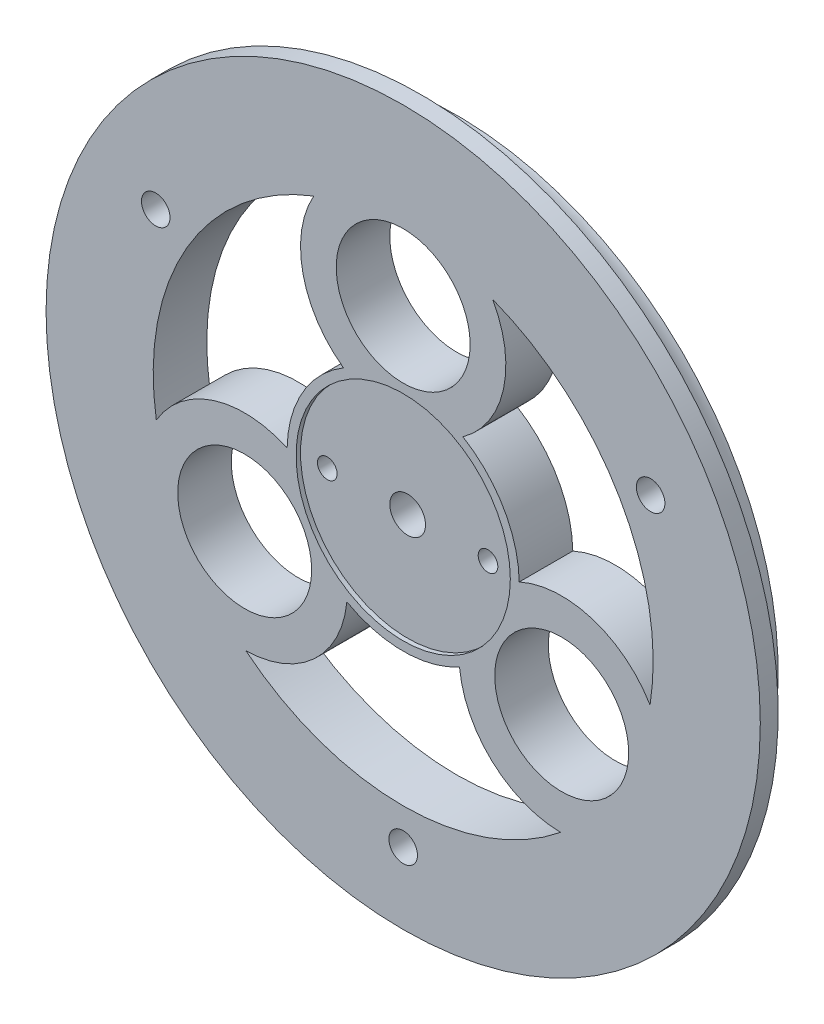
ISO-10303-21;
HEADER;
FILE_DESCRIPTION(('STEP AP214'),'2;1');
FILE_NAME('part.step','',(''),(''),'','','');
FILE_SCHEMA(('AUTOMOTIVE_DESIGN { 1 0 10303 214 1 1 1 1 }'));
ENDSEC;
DATA;
#1=APPLICATION_CONTEXT('core data for automotive mechanical design processes');
#2=APPLICATION_PROTOCOL_DEFINITION('international standard','automotive_design',2000,#1);
#3=PRODUCT_CONTEXT('',#1,'mechanical');
#4=PRODUCT('Part','Part','',(#3));
#5=PRODUCT_RELATED_PRODUCT_CATEGORY('part','',(#4));
#6=PRODUCT_DEFINITION_FORMATION('','',#4);
#7=PRODUCT_DEFINITION_CONTEXT('part definition',#1,'design');
#8=PRODUCT_DEFINITION('design','',#6,#7);
#9=PRODUCT_DEFINITION_SHAPE('','',#8);
#10=(LENGTH_UNIT() NAMED_UNIT(*) SI_UNIT(.MILLI.,.METRE.));
#11=(NAMED_UNIT(*) PLANE_ANGLE_UNIT() SI_UNIT($,.RADIAN.));
#12=(NAMED_UNIT(*) SI_UNIT($,.STERADIAN.) SOLID_ANGLE_UNIT());
#13=UNCERTAINTY_MEASURE_WITH_UNIT(LENGTH_MEASURE(1.E-05),#10,'distance_accuracy_value','');
#14=(GEOMETRIC_REPRESENTATION_CONTEXT(3) GLOBAL_UNCERTAINTY_ASSIGNED_CONTEXT((#13)) GLOBAL_UNIT_ASSIGNED_CONTEXT((#10,
#11,#12)) REPRESENTATION_CONTEXT('',''));
#15=CARTESIAN_POINT('',(0.,0.,0.));
#16=DIRECTION('',(0.,0.,1.));
#17=DIRECTION('',(1.,0.,0.));
#18=AXIS2_PLACEMENT_3D('',#15,#16,#17);
#19=CARTESIAN_POINT('',(0.,0.,6.));
#20=DIRECTION('',(0.,0.,-1.));
#21=DIRECTION('',(-1.,0.,0.));
#22=AXIS2_PLACEMENT_3D('',#19,#20,#21);
#23=CYLINDRICAL_SURFACE('',#22,2.);
#24=CARTESIAN_POINT('',(0.,0.,0.));
#25=DIRECTION('',(0.,0.,1.));
#26=DIRECTION('',(1.,0.,0.));
#27=AXIS2_PLACEMENT_3D('',#24,#25,#26);
#28=CIRCLE('',#27,2.);
#29=CARTESIAN_POINT('',(2.,0.,0.));
#30=VERTEX_POINT('',#29);
#31=EDGE_CURVE('E39',#30,#30,#28,.T.);
#32=ORIENTED_EDGE('',*,*,#31,.F.);
#33=EDGE_LOOP('',(#32));
#34=FACE_BOUND('',#33,.T.);
#35=CARTESIAN_POINT('',(0.,0.,5.5));
#36=DIRECTION('',(0.,0.,1.));
#37=DIRECTION('',(1.,0.,0.));
#38=AXIS2_PLACEMENT_3D('',#35,#36,#37);
#39=CIRCLE('',#38,2.);
#40=CARTESIAN_POINT('',(2.,0.,5.5));
#41=VERTEX_POINT('',#40);
#42=EDGE_CURVE('E268',#41,#41,#39,.T.);
#43=ORIENTED_EDGE('',*,*,#42,.T.);
#44=EDGE_LOOP('',(#43));
#45=FACE_BOUND('',#44,.T.);
#46=ADVANCED_FACE('F30',(#34,#45),#23,.F.);
#47=CARTESIAN_POINT('',(8.99999999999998,0.,6.));
#48=DIRECTION('',(0.,0.,-1.));
#49=DIRECTION('',(-1.,0.,0.));
#50=AXIS2_PLACEMENT_3D('',#47,#48,#49);
#51=CYLINDRICAL_SURFACE('',#50,1.1);
#52=CARTESIAN_POINT('',(8.99999999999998,0.,0.));
#53=DIRECTION('',(0.,0.,1.));
#54=DIRECTION('',(1.,0.,0.));
#55=AXIS2_PLACEMENT_3D('',#52,#53,#54);
#56=CIRCLE('',#55,1.1);
#57=CARTESIAN_POINT('',(10.1,0.,0.));
#58=VERTEX_POINT('',#57);
#59=EDGE_CURVE('E143',#58,#58,#56,.T.);
#60=ORIENTED_EDGE('',*,*,#59,.F.);
#61=EDGE_LOOP('',(#60));
#62=FACE_BOUND('',#61,.T.);
#63=CARTESIAN_POINT('',(8.99999999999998,0.,5.5));
#64=DIRECTION('',(0.,0.,1.));
#65=DIRECTION('',(1.,0.,0.));
#66=AXIS2_PLACEMENT_3D('',#63,#64,#65);
#67=CIRCLE('',#66,1.1);
#68=CARTESIAN_POINT('',(10.1,0.,5.5));
#69=VERTEX_POINT('',#68);
#70=EDGE_CURVE('E273',#69,#69,#67,.T.);
#71=ORIENTED_EDGE('',*,*,#70,.T.);
#72=EDGE_LOOP('',(#71));
#73=FACE_BOUND('',#72,.T.);
#74=ADVANCED_FACE('F329',(#62,#73),#51,.F.);
#75=CARTESIAN_POINT('',(-8.99999999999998,0.,6.));
#76=DIRECTION('',(0.,0.,-1.));
#77=DIRECTION('',(-1.,0.,0.));
#78=AXIS2_PLACEMENT_3D('',#75,#76,#77);
#79=CYLINDRICAL_SURFACE('',#78,1.1);
#80=CARTESIAN_POINT('',(-8.99999999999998,0.,0.));
#81=DIRECTION('',(0.,0.,1.));
#82=DIRECTION('',(-1.,0.,0.));
#83=AXIS2_PLACEMENT_3D('',#80,#81,#82);
#84=CIRCLE('',#83,1.1);
#85=CARTESIAN_POINT('',(-10.1,0.,0.));
#86=VERTEX_POINT('',#85);
#87=EDGE_CURVE('E146',#86,#86,#84,.T.);
#88=ORIENTED_EDGE('',*,*,#87,.F.);
#89=EDGE_LOOP('',(#88));
#90=FACE_BOUND('',#89,.T.);
#91=CARTESIAN_POINT('',(-8.99999999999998,0.,5.5));
#92=DIRECTION('',(0.,0.,1.));
#93=DIRECTION('',(1.,0.,0.));
#94=AXIS2_PLACEMENT_3D('',#91,#92,#93);
#95=CIRCLE('',#94,1.1);
#96=CARTESIAN_POINT('',(-7.89999999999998,0.,5.5));
#97=VERTEX_POINT('',#96);
#98=EDGE_CURVE('E34',#97,#97,#95,.T.);
#99=ORIENTED_EDGE('',*,*,#98,.T.);
#100=EDGE_LOOP('',(#99));
#101=FACE_BOUND('',#100,.T.);
#102=ADVANCED_FACE('F335',(#90,#101),#79,.F.);
#103=CARTESIAN_POINT('',(0.,0.,0.));
#104=DIRECTION('',(0.,0.,1.));
#105=DIRECTION('',(1.,0.,0.));
#106=AXIS2_PLACEMENT_3D('',#103,#104,#105);
#107=PLANE('',#106);
#108=ORIENTED_EDGE('',*,*,#87,.T.);
#109=EDGE_LOOP('',(#108));
#110=FACE_BOUND('',#109,.T.);
#111=CARTESIAN_POINT('',(0.,0.,0.));
#112=DIRECTION('',(0.,0.,1.));
#113=DIRECTION('',(1.,0.,0.));
#114=AXIS2_PLACEMENT_3D('',#111,#112,#113);
#115=CIRCLE('',#114,28.0000000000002);
#116=CARTESIAN_POINT('',(-10.0184244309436,26.1463414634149,0.));
#117=VERTEX_POINT('',#116);
#118=CARTESIAN_POINT('',(-27.6526081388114,-4.39696066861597,0.));
#119=VERTEX_POINT('',#118);
#120=EDGE_CURVE('E55',#117,#119,#115,.T.);
#121=ORIENTED_EDGE('',*,*,#120,.T.);
#122=CARTESIAN_POINT('',(-17.7535207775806,-10.2500000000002,0.));
#123=DIRECTION('',(0.,0.,-1.));
#124=DIRECTION('',(1.,0.,0.));
#125=AXIS2_PLACEMENT_3D('',#122,#123,#124);
#126=CIRCLE('',#125,11.5000000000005);
#127=CARTESIAN_POINT('',(-12.998125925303,0.220731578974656,0.));
#128=VERTEX_POINT('',#127);
#129=EDGE_CURVE('E123',#119,#128,#126,.T.);
#130=ORIENTED_EDGE('',*,*,#129,.T.);
#131=CARTESIAN_POINT('',(0.,0.,0.));
#132=DIRECTION('',(0.,0.,-1.));
#133=DIRECTION('',(1.,0.,0.));
#134=AXIS2_PLACEMENT_3D('',#131,#132,#133);
#135=CIRCLE('',#134,12.9999999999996);
#136=CARTESIAN_POINT('',(-6.69022211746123,11.146341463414,0.));
#137=VERTEX_POINT('',#136);
#138=EDGE_CURVE('E132',#128,#137,#135,.T.);
#139=ORIENTED_EDGE('',*,*,#138,.T.);
#140=CARTESIAN_POINT('',(0.,20.5,0.));
#141=DIRECTION('',(0.,0.,-1.));
#142=DIRECTION('',(1.,0.,0.));
#143=AXIS2_PLACEMENT_3D('',#140,#141,#142);
#144=CIRCLE('',#143,11.5000000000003);
#145=EDGE_CURVE('E142',#137,#117,#144,.T.);
#146=ORIENTED_EDGE('',*,*,#145,.T.);
#147=EDGE_LOOP('',(#121,#130,#139,#146));
#148=FACE_BOUND('',#147,.T.);
#149=CARTESIAN_POINT('',(1.77712048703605E-13,-32.0000000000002,0.));
#150=DIRECTION('',(0.,0.,1.));
#151=DIRECTION('',(1.,0.,0.));
#152=AXIS2_PLACEMENT_3D('',#149,#150,#151);
#153=CIRCLE('',#152,1.6);
#154=CARTESIAN_POINT('',(1.60000000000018,-32.0000000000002,0.));
#155=VERTEX_POINT('',#154);
#156=EDGE_CURVE('E168',#155,#155,#153,.T.);
#157=ORIENTED_EDGE('',*,*,#156,.T.);
#158=EDGE_LOOP('',(#157));
#159=FACE_BOUND('',#158,.T.);
#160=CARTESIAN_POINT('',(27.7128129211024,16.0000000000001,0.));
#161=DIRECTION('',(0.,0.,1.));
#162=DIRECTION('',(1.,0.,0.));
#163=AXIS2_PLACEMENT_3D('',#160,#161,#162);
#164=CIRCLE('',#163,1.6);
#165=CARTESIAN_POINT('',(29.3128129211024,16.0000000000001,0.));
#166=VERTEX_POINT('',#165);
#167=EDGE_CURVE('E180',#166,#166,#164,.T.);
#168=ORIENTED_EDGE('',*,*,#167,.T.);
#169=EDGE_LOOP('',(#168));
#170=FACE_BOUND('',#169,.T.);
#171=CARTESIAN_POINT('',(0.,20.5,0.));
#172=DIRECTION('',(0.,0.,-1.));
#173=DIRECTION('',(1.,0.,0.));
#174=AXIS2_PLACEMENT_3D('',#171,#172,#173);
#175=CIRCLE('',#174,11.5000000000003);
#176=CARTESIAN_POINT('',(10.0184244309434,26.1463414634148,0.));
#177=VERTEX_POINT('',#176);
#178=CARTESIAN_POINT('',(6.69022211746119,11.1463414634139,0.));
#179=VERTEX_POINT('',#178);
#180=EDGE_CURVE('E217',#177,#179,#175,.T.);
#181=ORIENTED_EDGE('',*,*,#180,.T.);
#182=CARTESIAN_POINT('',(0.,0.,0.));
#183=DIRECTION('',(0.,0.,-1.));
#184=DIRECTION('',(1.,0.,0.));
#185=AXIS2_PLACEMENT_3D('',#182,#183,#184);
#186=CIRCLE('',#185,12.9999999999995);
#187=CARTESIAN_POINT('',(12.9981259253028,0.220731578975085,0.));
#188=VERTEX_POINT('',#187);
#189=EDGE_CURVE('E220',#179,#188,#186,.T.);
#190=ORIENTED_EDGE('',*,*,#189,.T.);
#191=CARTESIAN_POINT('',(17.7535207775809,-10.2500000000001,0.));
#192=DIRECTION('',(0.,0.,-1.));
#193=DIRECTION('',(1.,0.,0.));
#194=AXIS2_PLACEMENT_3D('',#191,#192,#193);
#195=CIRCLE('',#194,11.5000000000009);
#196=CARTESIAN_POINT('',(27.6526081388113,-4.39696066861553,0.));
#197=VERTEX_POINT('',#196);
#198=EDGE_CURVE('E223',#188,#197,#195,.T.);
#199=ORIENTED_EDGE('',*,*,#198,.T.);
#200=CARTESIAN_POINT('',(0.,0.,0.));
#201=DIRECTION('',(0.,0.,1.));
#202=DIRECTION('',(1.,0.,0.));
#203=AXIS2_PLACEMENT_3D('',#200,#201,#202);
#204=CIRCLE('',#203,28.0000000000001);
#205=EDGE_CURVE('E226',#197,#177,#204,.T.);
#206=ORIENTED_EDGE('',*,*,#205,.T.);
#207=EDGE_LOOP('',(#181,#190,#199,#206));
#208=FACE_BOUND('',#207,.T.);
#209=CARTESIAN_POINT('',(0.,20.5,0.));
#210=DIRECTION('',(0.,0.,1.));
#211=DIRECTION('',(1.,0.,0.));
#212=AXIS2_PLACEMENT_3D('',#209,#210,#211);
#213=CIRCLE('',#212,7.5);
#214=CARTESIAN_POINT('',(7.5,20.5,0.));
#215=VERTEX_POINT('',#214);
#216=EDGE_CURVE('E254',#215,#215,#213,.T.);
#217=ORIENTED_EDGE('',*,*,#216,.T.);
#218=EDGE_LOOP('',(#217));
#219=FACE_BOUND('',#218,.T.);
#220=ORIENTED_EDGE('',*,*,#31,.T.);
#221=EDGE_LOOP('',(#220));
#222=FACE_BOUND('',#221,.T.);
#223=CARTESIAN_POINT('',(-27.712812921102,16.0000000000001,0.));
#224=DIRECTION('',(0.,0.,1.));
#225=DIRECTION('',(1.,0.,0.));
#226=AXIS2_PLACEMENT_3D('',#223,#224,#225);
#227=CIRCLE('',#226,1.6);
#228=CARTESIAN_POINT('',(-26.112812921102,16.0000000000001,0.));
#229=VERTEX_POINT('',#228);
#230=EDGE_CURVE('E248',#229,#229,#227,.T.);
#231=ORIENTED_EDGE('',*,*,#230,.T.);
#232=EDGE_LOOP('',(#231));
#233=FACE_BOUND('',#232,.T.);
#234=CARTESIAN_POINT('',(0.,0.,0.));
#235=DIRECTION('',(0.,0.,1.));
#236=DIRECTION('',(1.,0.,0.));
#237=AXIS2_PLACEMENT_3D('',#234,#235,#236);
#238=CIRCLE('',#237,28.);
#239=CARTESIAN_POINT('',(-17.6341837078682,-21.7493807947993,0.));
#240=VERTEX_POINT('',#239);
#241=CARTESIAN_POINT('',(17.6341837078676,-21.7493807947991,0.));
#242=VERTEX_POINT('',#241);
#243=EDGE_CURVE('E186',#240,#242,#238,.T.);
#244=ORIENTED_EDGE('',*,*,#243,.T.);
#245=CARTESIAN_POINT('',(17.7535207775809,-10.2500000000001,0.));
#246=DIRECTION('',(0.,0.,-1.));
#247=DIRECTION('',(1.,0.,0.));
#248=AXIS2_PLACEMENT_3D('',#245,#246,#247);
#249=CIRCLE('',#248,11.5);
#250=CARTESIAN_POINT('',(6.30790380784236,-11.367073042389,0.));
#251=VERTEX_POINT('',#250);
#252=EDGE_CURVE('E189',#242,#251,#249,.T.);
#253=ORIENTED_EDGE('',*,*,#252,.T.);
#254=CARTESIAN_POINT('',(0.,0.,0.));
#255=DIRECTION('',(0.,0.,-1.));
#256=DIRECTION('',(1.,0.,0.));
#257=AXIS2_PLACEMENT_3D('',#254,#255,#256);
#258=CIRCLE('',#257,13.);
#259=CARTESIAN_POINT('',(-6.30790380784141,-11.3670730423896,0.));
#260=VERTEX_POINT('',#259);
#261=EDGE_CURVE('E192',#251,#260,#258,.T.);
#262=ORIENTED_EDGE('',*,*,#261,.T.);
#263=CARTESIAN_POINT('',(-17.7535207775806,-10.2500000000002,0.));
#264=DIRECTION('',(0.,0.,-1.));
#265=DIRECTION('',(1.,0.,0.));
#266=AXIS2_PLACEMENT_3D('',#263,#264,#265);
#267=CIRCLE('',#266,11.5);
#268=EDGE_CURVE('E195',#260,#240,#267,.T.);
#269=ORIENTED_EDGE('',*,*,#268,.T.);
#270=EDGE_LOOP('',(#244,#253,#262,#269));
#271=FACE_BOUND('',#270,.T.);
#272=CARTESIAN_POINT('',(17.7535207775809,-10.2500000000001,0.));
#273=DIRECTION('',(0.,0.,1.));
#274=DIRECTION('',(1.,0.,0.));
#275=AXIS2_PLACEMENT_3D('',#272,#273,#274);
#276=CIRCLE('',#275,7.5);
#277=CARTESIAN_POINT('',(25.253520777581,-10.2500000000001,0.));
#278=VERTEX_POINT('',#277);
#279=EDGE_CURVE('E174',#278,#278,#276,.T.);
#280=ORIENTED_EDGE('',*,*,#279,.T.);
#281=EDGE_LOOP('',(#280));
#282=FACE_BOUND('',#281,.T.);
#283=CARTESIAN_POINT('',(-17.7535207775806,-10.2500000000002,0.));
#284=DIRECTION('',(0.,0.,1.));
#285=DIRECTION('',(1.,0.,0.));
#286=AXIS2_PLACEMENT_3D('',#283,#284,#285);
#287=CIRCLE('',#286,7.50000000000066);
#288=CARTESIAN_POINT('',(-10.2535207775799,-10.2500000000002,0.));
#289=VERTEX_POINT('',#288);
#290=EDGE_CURVE('E137',#289,#289,#287,.T.);
#291=ORIENTED_EDGE('',*,*,#290,.T.);
#292=EDGE_LOOP('',(#291));
#293=FACE_BOUND('',#292,.T.);
#294=ORIENTED_EDGE('',*,*,#59,.T.);
#295=EDGE_LOOP('',(#294));
#296=FACE_BOUND('',#295,.T.);
#297=CARTESIAN_POINT('',(0.,0.,0.));
#298=DIRECTION('',(0.,0.,-1.));
#299=DIRECTION('',(-1.,0.,0.));
#300=AXIS2_PLACEMENT_3D('',#297,#298,#299);
#301=CIRCLE('',#300,36.);
#302=CARTESIAN_POINT('',(-36.,0.,0.));
#303=VERTEX_POINT('',#302);
#304=EDGE_CURVE('E263',#303,#303,#301,.T.);
#305=ORIENTED_EDGE('',*,*,#304,.T.);
#306=EDGE_LOOP('',(#305));
#307=FACE_BOUND('',#306,.T.);
#308=ADVANCED_FACE('F140',(#110,#148,#159,#170,#208,#219,#222,#233,#271,#282,#293,#296,#307),
#107,.F.);
#309=CARTESIAN_POINT('',(0.,0.,6.));
#310=DIRECTION('',(0.,0.,-1.));
#311=DIRECTION('',(-1.,0.,0.));
#312=AXIS2_PLACEMENT_3D('',#309,#310,#311);
#313=CYLINDRICAL_SURFACE('',#312,40.);
#314=CARTESIAN_POINT('',(0.,0.,6.));
#315=DIRECTION('',(0.,0.,1.));
#316=DIRECTION('',(1.,0.,0.));
#317=AXIS2_PLACEMENT_3D('',#314,#315,#316);
#318=CIRCLE('',#317,40.);
#319=CARTESIAN_POINT('',(40.,0.,6.));
#320=VERTEX_POINT('',#319);
#321=EDGE_CURVE('E11',#320,#320,#318,.T.);
#322=ORIENTED_EDGE('',*,*,#321,.F.);
#323=EDGE_LOOP('',(#322));
#324=FACE_BOUND('',#323,.T.);
#325=CARTESIAN_POINT('',(0.,0.,4.));
#326=DIRECTION('',(0.,0.,-1.));
#327=DIRECTION('',(-1.,0.,0.));
#328=AXIS2_PLACEMENT_3D('',#325,#326,#327);
#329=CIRCLE('',#328,40.);
#330=CARTESIAN_POINT('',(-40.,0.,4.));
#331=VERTEX_POINT('',#330);
#332=EDGE_CURVE('E261',#331,#331,#329,.T.);
#333=ORIENTED_EDGE('',*,*,#332,.F.);
#334=EDGE_LOOP('',(#333));
#335=FACE_BOUND('',#334,.T.);
#336=ADVANCED_FACE('F32',(#324,#335),#313,.T.);
#337=CARTESIAN_POINT('',(0.,0.,6.));
#338=DIRECTION('',(0.,0.,1.));
#339=DIRECTION('',(1.,0.,0.));
#340=AXIS2_PLACEMENT_3D('',#337,#338,#339);
#341=PLANE('',#340);
#342=CARTESIAN_POINT('',(0.,0.,6.));
#343=DIRECTION('',(0.,0.,1.));
#344=DIRECTION('',(1.,0.,0.));
#345=AXIS2_PLACEMENT_3D('',#342,#343,#344);
#346=CIRCLE('',#345,12.);
#347=CARTESIAN_POINT('',(12.,0.,6.));
#348=VERTEX_POINT('',#347);
#349=EDGE_CURVE('E281',#348,#348,#346,.T.);
#350=ORIENTED_EDGE('',*,*,#349,.F.);
#351=EDGE_LOOP('',(#350));
#352=FACE_BOUND('',#351,.T.);
#353=CARTESIAN_POINT('',(-17.7535207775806,-10.2500000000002,6.));
#354=DIRECTION('',(0.,0.,1.));
#355=DIRECTION('',(1.,0.,0.));
#356=AXIS2_PLACEMENT_3D('',#353,#354,#355);
#357=CIRCLE('',#356,7.50000000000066);
#358=CARTESIAN_POINT('',(-10.2535207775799,-10.2500000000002,6.));
#359=VERTEX_POINT('',#358);
#360=EDGE_CURVE('E165',#359,#359,#357,.T.);
#361=ORIENTED_EDGE('',*,*,#360,.F.);
#362=EDGE_LOOP('',(#361));
#363=FACE_BOUND('',#362,.T.);
#364=CARTESIAN_POINT('',(17.7535207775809,-10.2500000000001,6.));
#365=DIRECTION('',(0.,0.,1.));
#366=DIRECTION('',(1.,0.,0.));
#367=AXIS2_PLACEMENT_3D('',#364,#365,#366);
#368=CIRCLE('',#367,7.5);
#369=CARTESIAN_POINT('',(25.253520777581,-10.2500000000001,6.));
#370=VERTEX_POINT('',#369);
#371=EDGE_CURVE('E177',#370,#370,#368,.T.);
#372=ORIENTED_EDGE('',*,*,#371,.F.);
#373=EDGE_LOOP('',(#372));
#374=FACE_BOUND('',#373,.T.);
#375=CARTESIAN_POINT('',(17.7535207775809,-10.2500000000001,6.));
#376=DIRECTION('',(0.,0.,-1.));
#377=DIRECTION('',(1.,0.,0.));
#378=AXIS2_PLACEMENT_3D('',#375,#376,#377);
#379=CIRCLE('',#378,11.5);
#380=CARTESIAN_POINT('',(17.6341837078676,-21.7493807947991,6.));
#381=VERTEX_POINT('',#380);
#382=CARTESIAN_POINT('',(6.30790380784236,-11.367073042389,6.));
#383=VERTEX_POINT('',#382);
#384=EDGE_CURVE('E200',#381,#383,#379,.T.);
#385=ORIENTED_EDGE('',*,*,#384,.F.);
#386=CARTESIAN_POINT('',(0.,0.,6.));
#387=DIRECTION('',(0.,0.,1.));
#388=DIRECTION('',(1.,0.,0.));
#389=AXIS2_PLACEMENT_3D('',#386,#387,#388);
#390=CIRCLE('',#389,28.);
#391=CARTESIAN_POINT('',(-17.6341837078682,-21.7493807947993,6.));
#392=VERTEX_POINT('',#391);
#393=EDGE_CURVE('E198',#392,#381,#390,.T.);
#394=ORIENTED_EDGE('',*,*,#393,.F.);
#395=CARTESIAN_POINT('',(-17.7535207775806,-10.2500000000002,6.));
#396=DIRECTION('',(0.,0.,-1.));
#397=DIRECTION('',(1.,0.,0.));
#398=AXIS2_PLACEMENT_3D('',#395,#396,#397);
#399=CIRCLE('',#398,11.5);
#400=CARTESIAN_POINT('',(-6.30790380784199,-11.3670730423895,6.));
#401=VERTEX_POINT('',#400);
#402=EDGE_CURVE('E205',#401,#392,#399,.T.);
#403=ORIENTED_EDGE('',*,*,#402,.F.);
#404=CARTESIAN_POINT('',(0.,0.,6.));
#405=DIRECTION('',(0.,0.,-1.));
#406=DIRECTION('',(1.,0.,0.));
#407=AXIS2_PLACEMENT_3D('',#404,#405,#406);
#408=CIRCLE('',#407,13.);
#409=EDGE_CURVE('E202',#383,#401,#408,.T.);
#410=ORIENTED_EDGE('',*,*,#409,.F.);
#411=EDGE_LOOP('',(#385,#394,#403,#410));
#412=FACE_BOUND('',#411,.T.);
#413=CARTESIAN_POINT('',(-27.712812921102,16.0000000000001,6.));
#414=DIRECTION('',(0.,0.,1.));
#415=DIRECTION('',(1.,0.,0.));
#416=AXIS2_PLACEMENT_3D('',#413,#414,#415);
#417=CIRCLE('',#416,1.6);
#418=CARTESIAN_POINT('',(-26.112812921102,16.0000000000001,6.));
#419=VERTEX_POINT('',#418);
#420=EDGE_CURVE('E251',#419,#419,#417,.T.);
#421=ORIENTED_EDGE('',*,*,#420,.F.);
#422=EDGE_LOOP('',(#421));
#423=FACE_BOUND('',#422,.T.);
#424=ORIENTED_EDGE('',*,*,#321,.T.);
#425=EDGE_LOOP('',(#424));
#426=FACE_BOUND('',#425,.T.);
#427=CARTESIAN_POINT('',(0.,20.5,6.));
#428=DIRECTION('',(0.,0.,1.));
#429=DIRECTION('',(1.,0.,0.));
#430=AXIS2_PLACEMENT_3D('',#427,#428,#429);
#431=CIRCLE('',#430,7.5);
#432=CARTESIAN_POINT('',(7.5,20.5,6.));
#433=VERTEX_POINT('',#432);
#434=EDGE_CURVE('E257',#433,#433,#431,.T.);
#435=ORIENTED_EDGE('',*,*,#434,.F.);
#436=EDGE_LOOP('',(#435));
#437=FACE_BOUND('',#436,.T.);
#438=CARTESIAN_POINT('',(0.,0.,6.));
#439=DIRECTION('',(0.,0.,-1.));
#440=DIRECTION('',(1.,0.,0.));
#441=AXIS2_PLACEMENT_3D('',#438,#439,#440);
#442=CIRCLE('',#441,12.9999999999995);
#443=CARTESIAN_POINT('',(6.69022211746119,11.1463414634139,6.));
#444=VERTEX_POINT('',#443);
#445=CARTESIAN_POINT('',(12.9981259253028,0.220731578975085,6.));
#446=VERTEX_POINT('',#445);
#447=EDGE_CURVE('E231',#444,#446,#442,.T.);
#448=ORIENTED_EDGE('',*,*,#447,.F.);
#449=CARTESIAN_POINT('',(0.,20.5,6.));
#450=DIRECTION('',(0.,0.,-1.));
#451=DIRECTION('',(1.,0.,0.));
#452=AXIS2_PLACEMENT_3D('',#449,#450,#451);
#453=CIRCLE('',#452,11.5000000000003);
#454=CARTESIAN_POINT('',(10.0184244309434,26.1463414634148,6.));
#455=VERTEX_POINT('',#454);
#456=EDGE_CURVE('E229',#455,#444,#453,.T.);
#457=ORIENTED_EDGE('',*,*,#456,.F.);
#458=CARTESIAN_POINT('',(0.,0.,6.));
#459=DIRECTION('',(0.,0.,1.));
#460=DIRECTION('',(1.,0.,0.));
#461=AXIS2_PLACEMENT_3D('',#458,#459,#460);
#462=CIRCLE('',#461,28.0000000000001);
#463=CARTESIAN_POINT('',(27.6526081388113,-4.39696066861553,6.));
#464=VERTEX_POINT('',#463);
#465=EDGE_CURVE('E236',#464,#455,#462,.T.);
#466=ORIENTED_EDGE('',*,*,#465,.F.);
#467=CARTESIAN_POINT('',(17.7535207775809,-10.2500000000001,6.));
#468=DIRECTION('',(0.,0.,-1.));
#469=DIRECTION('',(1.,0.,0.));
#470=AXIS2_PLACEMENT_3D('',#467,#468,#469);
#471=CIRCLE('',#470,11.5000000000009);
#472=EDGE_CURVE('E233',#446,#464,#471,.T.);
#473=ORIENTED_EDGE('',*,*,#472,.F.);
#474=EDGE_LOOP('',(#448,#457,#466,#473));
#475=FACE_BOUND('',#474,.T.);
#476=CARTESIAN_POINT('',(27.7128129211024,16.0000000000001,6.));
#477=DIRECTION('',(0.,0.,1.));
#478=DIRECTION('',(1.,0.,0.));
#479=AXIS2_PLACEMENT_3D('',#476,#477,#478);
#480=CIRCLE('',#479,1.6);
#481=CARTESIAN_POINT('',(29.3128129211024,16.0000000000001,6.));
#482=VERTEX_POINT('',#481);
#483=EDGE_CURVE('E183',#482,#482,#480,.T.);
#484=ORIENTED_EDGE('',*,*,#483,.F.);
#485=EDGE_LOOP('',(#484));
#486=FACE_BOUND('',#485,.T.);
#487=CARTESIAN_POINT('',(1.77712048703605E-13,-32.0000000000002,6.));
#488=DIRECTION('',(0.,0.,1.));
#489=DIRECTION('',(1.,0.,0.));
#490=AXIS2_PLACEMENT_3D('',#487,#488,#489);
#491=CIRCLE('',#490,1.6);
#492=CARTESIAN_POINT('',(1.60000000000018,-32.0000000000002,6.));
#493=VERTEX_POINT('',#492);
#494=EDGE_CURVE('E171',#493,#493,#491,.T.);
#495=ORIENTED_EDGE('',*,*,#494,.F.);
#496=EDGE_LOOP('',(#495));
#497=FACE_BOUND('',#496,.T.);
#498=CARTESIAN_POINT('',(-17.7535207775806,-10.2500000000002,6.));
#499=DIRECTION('',(0.,0.,-1.));
#500=DIRECTION('',(1.,0.,0.));
#501=AXIS2_PLACEMENT_3D('',#498,#499,#500);
#502=CIRCLE('',#501,11.5000000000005);
#503=CARTESIAN_POINT('',(-27.6526081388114,-4.39696066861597,6.));
#504=VERTEX_POINT('',#503);
#505=CARTESIAN_POINT('',(-12.998125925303,0.220731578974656,6.));
#506=VERTEX_POINT('',#505);
#507=EDGE_CURVE('E153',#504,#506,#502,.T.);
#508=ORIENTED_EDGE('',*,*,#507,.F.);
#509=CARTESIAN_POINT('',(0.,0.,6.));
#510=DIRECTION('',(0.,0.,1.));
#511=DIRECTION('',(1.,0.,0.));
#512=AXIS2_PLACEMENT_3D('',#509,#510,#511);
#513=CIRCLE('',#512,28.0000000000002);
#514=CARTESIAN_POINT('',(-10.0184244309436,26.1463414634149,6.));
#515=VERTEX_POINT('',#514);
#516=EDGE_CURVE('E136',#515,#504,#513,.T.);
#517=ORIENTED_EDGE('',*,*,#516,.F.);
#518=CARTESIAN_POINT('',(0.,20.5,6.));
#519=DIRECTION('',(0.,0.,-1.));
#520=DIRECTION('',(1.,0.,0.));
#521=AXIS2_PLACEMENT_3D('',#518,#519,#520);
#522=CIRCLE('',#521,11.5000000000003);
#523=CARTESIAN_POINT('',(-6.69022211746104,11.1463414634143,6.));
#524=VERTEX_POINT('',#523);
#525=EDGE_CURVE('E157',#524,#515,#522,.T.);
#526=ORIENTED_EDGE('',*,*,#525,.F.);
#527=CARTESIAN_POINT('',(0.,0.,6.));
#528=DIRECTION('',(0.,0.,-1.));
#529=DIRECTION('',(1.,0.,0.));
#530=AXIS2_PLACEMENT_3D('',#527,#528,#529);
#531=CIRCLE('',#530,12.9999999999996);
#532=EDGE_CURVE('E155',#506,#524,#531,.T.);
#533=ORIENTED_EDGE('',*,*,#532,.F.);
#534=EDGE_LOOP('',(#508,#517,#526,#533));
#535=FACE_BOUND('',#534,.T.);
#536=ADVANCED_FACE('F287',(#352,#363,#374,#412,#423,#426,#437,#475,#486,#497,#535),#341,.T.);
#537=CARTESIAN_POINT('',(0.,20.5,6.));
#538=DIRECTION('',(0.,0.,-1.));
#539=DIRECTION('',(-1.,0.,0.));
#540=AXIS2_PLACEMENT_3D('',#537,#538,#539);
#541=CYLINDRICAL_SURFACE('',#540,7.5);
#542=ORIENTED_EDGE('',*,*,#434,.T.);
#543=EDGE_LOOP('',(#542));
#544=FACE_BOUND('',#543,.T.);
#545=ORIENTED_EDGE('',*,*,#216,.F.);
#546=EDGE_LOOP('',(#545));
#547=FACE_BOUND('',#546,.T.);
#548=ADVANCED_FACE('F290',(#544,#547),#541,.F.);
#549=CARTESIAN_POINT('',(-27.712812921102,16.0000000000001,6.));
#550=DIRECTION('',(0.,0.,-1.));
#551=DIRECTION('',(-1.,0.,0.));
#552=AXIS2_PLACEMENT_3D('',#549,#550,#551);
#553=CYLINDRICAL_SURFACE('',#552,1.6);
#554=ORIENTED_EDGE('',*,*,#420,.T.);
#555=EDGE_LOOP('',(#554));
#556=FACE_BOUND('',#555,.T.);
#557=ORIENTED_EDGE('',*,*,#230,.F.);
#558=EDGE_LOOP('',(#557));
#559=FACE_BOUND('',#558,.T.);
#560=ADVANCED_FACE('F536',(#556,#559),#553,.F.);
#561=CARTESIAN_POINT('',(0.,20.5,6.));
#562=DIRECTION('',(0.,0.,-1.));
#563=DIRECTION('',(-1.,0.,0.));
#564=AXIS2_PLACEMENT_3D('',#561,#562,#563);
#565=CYLINDRICAL_SURFACE('',#564,11.5000000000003);
#566=ORIENTED_EDGE('',*,*,#180,.F.);
#567=DIRECTION('',(0.,0.,-1.));
#568=VECTOR('',#567,1.);
#569=CARTESIAN_POINT('',(10.0184244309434,26.1463414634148,6.));
#570=LINE('',#569,#568);
#571=EDGE_CURVE('E238',#455,#177,#570,.T.);
#572=ORIENTED_EDGE('',*,*,#571,.F.);
#573=ORIENTED_EDGE('',*,*,#456,.T.);
#574=DIRECTION('',(0.,0.,-1.));
#575=VECTOR('',#574,1.);
#576=CARTESIAN_POINT('',(6.69022211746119,11.1463414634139,6.));
#577=LINE('',#576,#575);
#578=EDGE_CURVE('E245',#444,#179,#577,.T.);
#579=ORIENTED_EDGE('',*,*,#578,.T.);
#580=EDGE_LOOP('',(#566,#572,#573,#579));
#581=FACE_BOUND('',#580,.T.);
#582=ADVANCED_FACE('F527',(#581),#565,.T.);
#583=CARTESIAN_POINT('',(0.,0.,6.));
#584=DIRECTION('',(0.,0.,-1.));
#585=DIRECTION('',(-1.,0.,0.));
#586=AXIS2_PLACEMENT_3D('',#583,#584,#585);
#587=CYLINDRICAL_SURFACE('',#586,12.9999999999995);
#588=ORIENTED_EDGE('',*,*,#189,.F.);
#589=ORIENTED_EDGE('',*,*,#578,.F.);
#590=ORIENTED_EDGE('',*,*,#447,.T.);
#591=DIRECTION('',(0.,0.,-1.));
#592=VECTOR('',#591,1.);
#593=CARTESIAN_POINT('',(12.9981259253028,0.220731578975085,6.));
#594=LINE('',#593,#592);
#595=EDGE_CURVE('E243',#446,#188,#594,.T.);
#596=ORIENTED_EDGE('',*,*,#595,.T.);
#597=EDGE_LOOP('',(#588,#589,#590,#596));
#598=FACE_BOUND('',#597,.T.);
#599=ADVANCED_FACE('F518',(#598),#587,.T.);
#600=CARTESIAN_POINT('',(17.7535207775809,-10.2500000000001,6.));
#601=DIRECTION('',(0.,0.,-1.));
#602=DIRECTION('',(-1.,0.,0.));
#603=AXIS2_PLACEMENT_3D('',#600,#601,#602);
#604=CYLINDRICAL_SURFACE('',#603,11.5000000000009);
#605=ORIENTED_EDGE('',*,*,#198,.F.);
#606=ORIENTED_EDGE('',*,*,#595,.F.);
#607=ORIENTED_EDGE('',*,*,#472,.T.);
#608=DIRECTION('',(0.,0.,-1.));
#609=VECTOR('',#608,1.);
#610=CARTESIAN_POINT('',(27.6526081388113,-4.39696066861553,6.));
#611=LINE('',#610,#609);
#612=EDGE_CURVE('E241',#464,#197,#611,.T.);
#613=ORIENTED_EDGE('',*,*,#612,.T.);
#614=EDGE_LOOP('',(#605,#606,#607,#613));
#615=FACE_BOUND('',#614,.T.);
#616=ADVANCED_FACE('F509',(#615),#604,.T.);
#617=CARTESIAN_POINT('',(0.,0.,6.));
#618=DIRECTION('',(0.,0.,-1.));
#619=DIRECTION('',(-1.,0.,0.));
#620=AXIS2_PLACEMENT_3D('',#617,#618,#619);
#621=CYLINDRICAL_SURFACE('',#620,28.0000000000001);
#622=ORIENTED_EDGE('',*,*,#205,.F.);
#623=ORIENTED_EDGE('',*,*,#612,.F.);
#624=ORIENTED_EDGE('',*,*,#465,.T.);
#625=ORIENTED_EDGE('',*,*,#571,.T.);
#626=EDGE_LOOP('',(#622,#623,#624,#625));
#627=FACE_BOUND('',#626,.T.);
#628=ADVANCED_FACE('F500',(#627),#621,.F.);
#629=CARTESIAN_POINT('',(0.,0.,6.));
#630=DIRECTION('',(0.,0.,-1.));
#631=DIRECTION('',(-1.,0.,0.));
#632=AXIS2_PLACEMENT_3D('',#629,#630,#631);
#633=CYLINDRICAL_SURFACE('',#632,28.);
#634=ORIENTED_EDGE('',*,*,#243,.F.);
#635=DIRECTION('',(0.,0.,-1.));
#636=VECTOR('',#635,1.);
#637=CARTESIAN_POINT('',(-17.6341837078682,-21.7493807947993,6.));
#638=LINE('',#637,#636);
#639=EDGE_CURVE('E207',#392,#240,#638,.T.);
#640=ORIENTED_EDGE('',*,*,#639,.F.);
#641=ORIENTED_EDGE('',*,*,#393,.T.);
#642=DIRECTION('',(0.,0.,-1.));
#643=VECTOR('',#642,1.);
#644=CARTESIAN_POINT('',(17.6341837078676,-21.7493807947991,6.));
#645=LINE('',#644,#643);
#646=EDGE_CURVE('E214',#381,#242,#645,.T.);
#647=ORIENTED_EDGE('',*,*,#646,.T.);
#648=EDGE_LOOP('',(#634,#640,#641,#647));
#649=FACE_BOUND('',#648,.T.);
#650=ADVANCED_FACE('F491',(#649),#633,.F.);
#651=CARTESIAN_POINT('',(17.7535207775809,-10.2500000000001,6.));
#652=DIRECTION('',(0.,0.,-1.));
#653=DIRECTION('',(-1.,0.,0.));
#654=AXIS2_PLACEMENT_3D('',#651,#652,#653);
#655=CYLINDRICAL_SURFACE('',#654,11.5);
#656=ORIENTED_EDGE('',*,*,#252,.F.);
#657=ORIENTED_EDGE('',*,*,#646,.F.);
#658=ORIENTED_EDGE('',*,*,#384,.T.);
#659=DIRECTION('',(0.,0.,-1.));
#660=VECTOR('',#659,1.);
#661=CARTESIAN_POINT('',(6.30790380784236,-11.367073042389,6.));
#662=LINE('',#661,#660);
#663=EDGE_CURVE('E212',#383,#251,#662,.T.);
#664=ORIENTED_EDGE('',*,*,#663,.T.);
#665=EDGE_LOOP('',(#656,#657,#658,#664));
#666=FACE_BOUND('',#665,.T.);
#667=ADVANCED_FACE('F482',(#666),#655,.T.);
#668=CARTESIAN_POINT('',(0.,0.,6.));
#669=DIRECTION('',(0.,0.,-1.));
#670=DIRECTION('',(-1.,0.,0.));
#671=AXIS2_PLACEMENT_3D('',#668,#669,#670);
#672=CYLINDRICAL_SURFACE('',#671,13.);
#673=ORIENTED_EDGE('',*,*,#261,.F.);
#674=ORIENTED_EDGE('',*,*,#663,.F.);
#675=ORIENTED_EDGE('',*,*,#409,.T.);
#676=DIRECTION('',(0.,0.,-1.));
#677=VECTOR('',#676,1.);
#678=CARTESIAN_POINT('',(-6.30790380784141,-11.3670730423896,6.));
#679=LINE('',#678,#677);
#680=EDGE_CURVE('E210',#401,#260,#679,.T.);
#681=ORIENTED_EDGE('',*,*,#680,.T.);
#682=EDGE_LOOP('',(#673,#674,#675,#681));
#683=FACE_BOUND('',#682,.T.);
#684=ADVANCED_FACE('F473',(#683),#672,.T.);
#685=CARTESIAN_POINT('',(-17.7535207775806,-10.2500000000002,6.));
#686=DIRECTION('',(0.,0.,-1.));
#687=DIRECTION('',(-1.,0.,0.));
#688=AXIS2_PLACEMENT_3D('',#685,#686,#687);
#689=CYLINDRICAL_SURFACE('',#688,11.5);
#690=ORIENTED_EDGE('',*,*,#268,.F.);
#691=ORIENTED_EDGE('',*,*,#680,.F.);
#692=ORIENTED_EDGE('',*,*,#402,.T.);
#693=ORIENTED_EDGE('',*,*,#639,.T.);
#694=EDGE_LOOP('',(#690,#691,#692,#693));
#695=FACE_BOUND('',#694,.T.);
#696=ADVANCED_FACE('F464',(#695),#689,.T.);
#697=CARTESIAN_POINT('',(27.7128129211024,16.0000000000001,6.));
#698=DIRECTION('',(0.,0.,-1.));
#699=DIRECTION('',(-1.,0.,0.));
#700=AXIS2_PLACEMENT_3D('',#697,#698,#699);
#701=CYLINDRICAL_SURFACE('',#700,1.6);
#702=ORIENTED_EDGE('',*,*,#483,.T.);
#703=EDGE_LOOP('',(#702));
#704=FACE_BOUND('',#703,.T.);
#705=ORIENTED_EDGE('',*,*,#167,.F.);
#706=EDGE_LOOP('',(#705));
#707=FACE_BOUND('',#706,.T.);
#708=ADVANCED_FACE('F455',(#704,#707),#701,.F.);
#709=CARTESIAN_POINT('',(17.7535207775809,-10.2500000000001,6.));
#710=DIRECTION('',(0.,0.,-1.));
#711=DIRECTION('',(-1.,0.,0.));
#712=AXIS2_PLACEMENT_3D('',#709,#710,#711);
#713=CYLINDRICAL_SURFACE('',#712,7.5);
#714=ORIENTED_EDGE('',*,*,#371,.T.);
#715=EDGE_LOOP('',(#714));
#716=FACE_BOUND('',#715,.T.);
#717=ORIENTED_EDGE('',*,*,#279,.F.);
#718=EDGE_LOOP('',(#717));
#719=FACE_BOUND('',#718,.T.);
#720=ADVANCED_FACE('F446',(#716,#719),#713,.F.);
#721=CARTESIAN_POINT('',(1.77712048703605E-13,-32.0000000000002,6.));
#722=DIRECTION('',(0.,0.,-1.));
#723=DIRECTION('',(-1.,0.,0.));
#724=AXIS2_PLACEMENT_3D('',#721,#722,#723);
#725=CYLINDRICAL_SURFACE('',#724,1.6);
#726=ORIENTED_EDGE('',*,*,#494,.T.);
#727=EDGE_LOOP('',(#726));
#728=FACE_BOUND('',#727,.T.);
#729=ORIENTED_EDGE('',*,*,#156,.F.);
#730=EDGE_LOOP('',(#729));
#731=FACE_BOUND('',#730,.T.);
#732=ADVANCED_FACE('F437',(#728,#731),#725,.F.);
#733=CARTESIAN_POINT('',(-17.7535207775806,-10.2500000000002,6.));
#734=DIRECTION('',(0.,0.,-1.));
#735=DIRECTION('',(-1.,0.,0.));
#736=AXIS2_PLACEMENT_3D('',#733,#734,#735);
#737=CYLINDRICAL_SURFACE('',#736,7.50000000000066);
#738=ORIENTED_EDGE('',*,*,#360,.T.);
#739=EDGE_LOOP('',(#738));
#740=FACE_BOUND('',#739,.T.);
#741=ORIENTED_EDGE('',*,*,#290,.F.);
#742=EDGE_LOOP('',(#741));
#743=FACE_BOUND('',#742,.T.);
#744=ADVANCED_FACE('F429',(#740,#743),#737,.F.);
#745=CARTESIAN_POINT('',(0.,0.,6.));
#746=DIRECTION('',(0.,0.,-1.));
#747=DIRECTION('',(-1.,0.,0.));
#748=AXIS2_PLACEMENT_3D('',#745,#746,#747);
#749=CYLINDRICAL_SURFACE('',#748,28.0000000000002);
#750=ORIENTED_EDGE('',*,*,#120,.F.);
#751=DIRECTION('',(0.,0.,-1.));
#752=VECTOR('',#751,1.);
#753=CARTESIAN_POINT('',(-10.0184244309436,26.1463414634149,6.));
#754=LINE('',#753,#752);
#755=EDGE_CURVE('E159',#515,#117,#754,.T.);
#756=ORIENTED_EDGE('',*,*,#755,.F.);
#757=ORIENTED_EDGE('',*,*,#516,.T.);
#758=DIRECTION('',(0.,0.,-1.));
#759=VECTOR('',#758,1.);
#760=CARTESIAN_POINT('',(-27.6526081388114,-4.39696066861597,6.));
#761=LINE('',#760,#759);
#762=EDGE_CURVE('E125',#504,#119,#761,.T.);
#763=ORIENTED_EDGE('',*,*,#762,.T.);
#764=EDGE_LOOP('',(#750,#756,#757,#763));
#765=FACE_BOUND('',#764,.T.);
#766=ADVANCED_FACE('F134',(#765),#749,.F.);
#767=CARTESIAN_POINT('',(-17.7535207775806,-10.2500000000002,6.));
#768=DIRECTION('',(0.,0.,-1.));
#769=DIRECTION('',(-1.,0.,0.));
#770=AXIS2_PLACEMENT_3D('',#767,#768,#769);
#771=CYLINDRICAL_SURFACE('',#770,11.5000000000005);
#772=ORIENTED_EDGE('',*,*,#129,.F.);
#773=ORIENTED_EDGE('',*,*,#762,.F.);
#774=ORIENTED_EDGE('',*,*,#507,.T.);
#775=DIRECTION('',(0.,0.,-1.));
#776=VECTOR('',#775,1.);
#777=CARTESIAN_POINT('',(-12.998125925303,0.220731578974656,6.));
#778=LINE('',#777,#776);
#779=EDGE_CURVE('E128',#506,#128,#778,.T.);
#780=ORIENTED_EDGE('',*,*,#779,.T.);
#781=EDGE_LOOP('',(#772,#773,#774,#780));
#782=FACE_BOUND('',#781,.T.);
#783=ADVANCED_FACE('F124',(#782),#771,.T.);
#784=CARTESIAN_POINT('',(0.,0.,6.));
#785=DIRECTION('',(0.,0.,-1.));
#786=DIRECTION('',(-1.,0.,0.));
#787=AXIS2_PLACEMENT_3D('',#784,#785,#786);
#788=CYLINDRICAL_SURFACE('',#787,12.9999999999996);
#789=ORIENTED_EDGE('',*,*,#138,.F.);
#790=ORIENTED_EDGE('',*,*,#779,.F.);
#791=ORIENTED_EDGE('',*,*,#532,.T.);
#792=DIRECTION('',(0.,0.,-1.));
#793=VECTOR('',#792,1.);
#794=CARTESIAN_POINT('',(-6.69022211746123,11.146341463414,6.));
#795=LINE('',#794,#793);
#796=EDGE_CURVE('E47',#524,#137,#795,.T.);
#797=ORIENTED_EDGE('',*,*,#796,.T.);
#798=EDGE_LOOP('',(#789,#790,#791,#797));
#799=FACE_BOUND('',#798,.T.);
#800=ADVANCED_FACE('F316',(#799),#788,.T.);
#801=CARTESIAN_POINT('',(0.,20.5,6.));
#802=DIRECTION('',(0.,0.,-1.));
#803=DIRECTION('',(-1.,0.,0.));
#804=AXIS2_PLACEMENT_3D('',#801,#802,#803);
#805=CYLINDRICAL_SURFACE('',#804,11.5000000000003);
#806=ORIENTED_EDGE('',*,*,#145,.F.);
#807=ORIENTED_EDGE('',*,*,#796,.F.);
#808=ORIENTED_EDGE('',*,*,#525,.T.);
#809=ORIENTED_EDGE('',*,*,#755,.T.);
#810=EDGE_LOOP('',(#806,#807,#808,#809));
#811=FACE_BOUND('',#810,.T.);
#812=ADVANCED_FACE('F317',(#811),#805,.T.);
#813=CARTESIAN_POINT('',(0.,0.,0.));
#814=DIRECTION('',(0.,0.,-1.));
#815=DIRECTION('',(-1.,0.,0.));
#816=AXIS2_PLACEMENT_3D('',#813,#814,#815);
#817=TOROIDAL_SURFACE('',#816,40.,4.);
#818=ORIENTED_EDGE('',*,*,#332,.T.);
#819=EDGE_LOOP('',(#818));
#820=FACE_BOUND('',#819,.T.);
#821=ORIENTED_EDGE('',*,*,#304,.F.);
#822=EDGE_LOOP('',(#821));
#823=FACE_BOUND('',#822,.T.);
#824=ADVANCED_FACE('F319',(#820,#823),#817,.F.);
#825=CARTESIAN_POINT('',(0.,0.,5.5));
#826=DIRECTION('',(0.,0.,1.));
#827=DIRECTION('',(1.,0.,0.));
#828=AXIS2_PLACEMENT_3D('',#825,#826,#827);
#829=CYLINDRICAL_SURFACE('',#828,12.);
#830=CARTESIAN_POINT('',(0.,0.,5.5));
#831=DIRECTION('',(0.,0.,1.));
#832=DIRECTION('',(1.,0.,0.));
#833=AXIS2_PLACEMENT_3D('',#830,#831,#832);
#834=CIRCLE('',#833,12.);
#835=CARTESIAN_POINT('',(12.,0.,5.5));
#836=VERTEX_POINT('',#835);
#837=EDGE_CURVE('E278',#836,#836,#834,.T.);
#838=ORIENTED_EDGE('',*,*,#837,.F.);
#839=EDGE_LOOP('',(#838));
#840=FACE_BOUND('',#839,.T.);
#841=ORIENTED_EDGE('',*,*,#349,.T.);
#842=EDGE_LOOP('',(#841));
#843=FACE_BOUND('',#842,.T.);
#844=ADVANCED_FACE('F285',(#840,#843),#829,.F.);
#845=CARTESIAN_POINT('',(0.,0.,5.5));
#846=DIRECTION('',(0.,0.,1.));
#847=DIRECTION('',(1.,0.,0.));
#848=AXIS2_PLACEMENT_3D('',#845,#846,#847);
#849=PLANE('',#848);
#850=ORIENTED_EDGE('',*,*,#42,.F.);
#851=EDGE_LOOP('',(#850));
#852=FACE_BOUND('',#851,.T.);
#853=ORIENTED_EDGE('',*,*,#70,.F.);
#854=EDGE_LOOP('',(#853));
#855=FACE_BOUND('',#854,.T.);
#856=ORIENTED_EDGE('',*,*,#98,.F.);
#857=EDGE_LOOP('',(#856));
#858=FACE_BOUND('',#857,.T.);
#859=ORIENTED_EDGE('',*,*,#837,.T.);
#860=EDGE_LOOP('',(#859));
#861=FACE_BOUND('',#860,.T.);
#862=ADVANCED_FACE('F356',(#852,#855,#858,#861),#849,.T.);
#863=CLOSED_SHELL('',(#46,#74,#102,#308,#336,#536,#548,#560,#582,#599,#616,#628,#650,#667,#684,
#696,#708,#720,#732,#744,#766,#783,#800,#812,#824,#844,#862));
#864=MANIFOLD_SOLID_BREP('B2',#863);
#865=ADVANCED_BREP_SHAPE_REPRESENTATION('',(#18,#864),#14);
#866=SHAPE_DEFINITION_REPRESENTATION(#9,#865);
ENDSEC;
END-ISO-10303-21;
